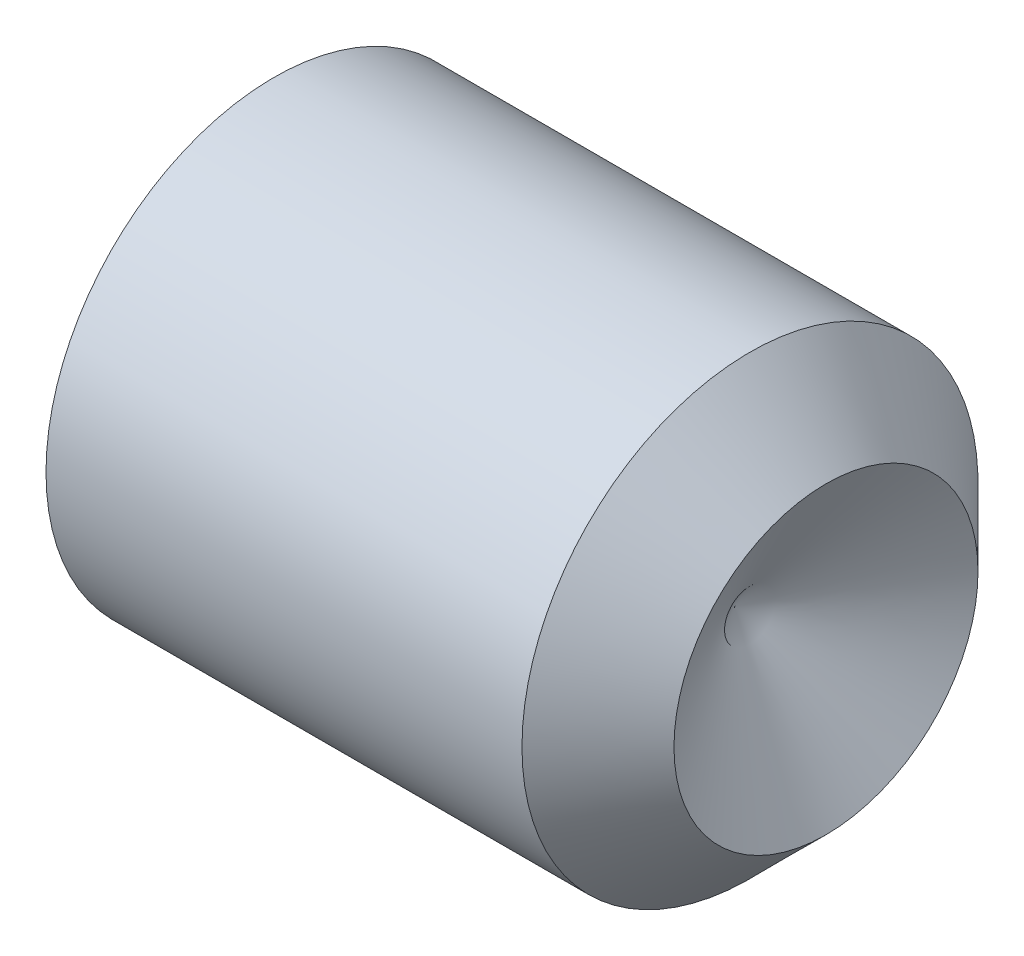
from build123d import *

# Parameters (mm, degrees)
SPLINE4_DEPTH     = 12
CIRPATTERN2_COUNT = 4


with BuildPart() as part:
    # BodySke → BaseBody (revolve)
    with BuildSketch(Plane.XY, mode=Mode.PRIVATE) as basebody_sk:
        Polygon((0, 0), (0, 10.352), (0.951473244, 12), (26, 12), (30, 8), (25.193115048, 0), align=None)
    revolve(basebody_sk.sketch.rotate(Axis((-12.7, 0, 0), (1, 0, 0)), 90), axis=Axis((-12.7, 0, 0), (1, 0, 0)))

    # Sketch5 → Spline4 (cut)
    with BuildSketch(Plane(origin=(0, 1.522651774, 6.19807627), x_dir=(0, 0, 1), z_dir=(-1, 0, 0))):
        with BuildLine():
            Line((-6.19807627, -1.522651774), (1.47292373, -1.522651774))
            ThreePointArc((1.47292373, -1.522651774), (1.179556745, 0.578484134), (0.321894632, 2.51890986))
            Line((0.321894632, 2.51890986), (-0.387779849, 1.809235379))
            Line((-0.387779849, 1.809235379), (-2.866189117, 4.287644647))
            Line((-2.866189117, 4.287644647), (-2.156514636, 4.997319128))
            ThreePointArc((-2.156514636, 4.997319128), (-4.096940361, 5.85498124), (-6.19807627, 6.148348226))
            Line((-6.19807627, 6.148348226), (-6.19807627, -1.522651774))
        make_face()
    spline4 = extrude(amount=-SPLINE4_DEPTH, mode=Mode.SUBTRACT)

    # CirPattern2: Spline4 ×4 about axis
    cirpattern2_axis = Axis((0, 0, 0), (1, 0, 0))
    for i in range(1, CIRPATTERN2_COUNT):
        add(spline4.rotate(cirpattern2_axis, i * 360 / CIRPATTERN2_COUNT), mode=Mode.SUBTRACT)


solid = part.part
